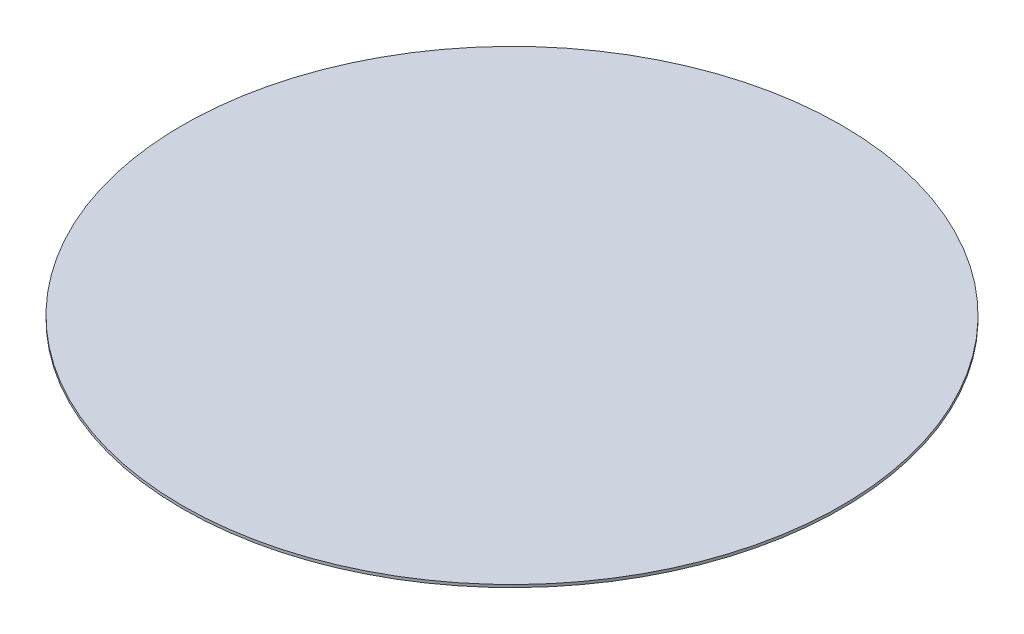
from build123d import *

# Parameters (mm, degrees)
CROQUIS4_R              = 247
SALIENTE_EXTRUIR1_DEPTH = 2


with BuildPart() as part:
    # Croquis4 → Saliente-Extruir1 (new body)
    with BuildSketch(Plane(origin=(0, 0, 0), x_dir=(1, 0, 0), z_dir=(0, 1, 0))):
        with Locations(Location((0, 0, 0), (0, 0, 270))):
            Circle(CROQUIS4_R)
    extrude(amount=SALIENTE_EXTRUIR1_DEPTH)


solid = part.part
